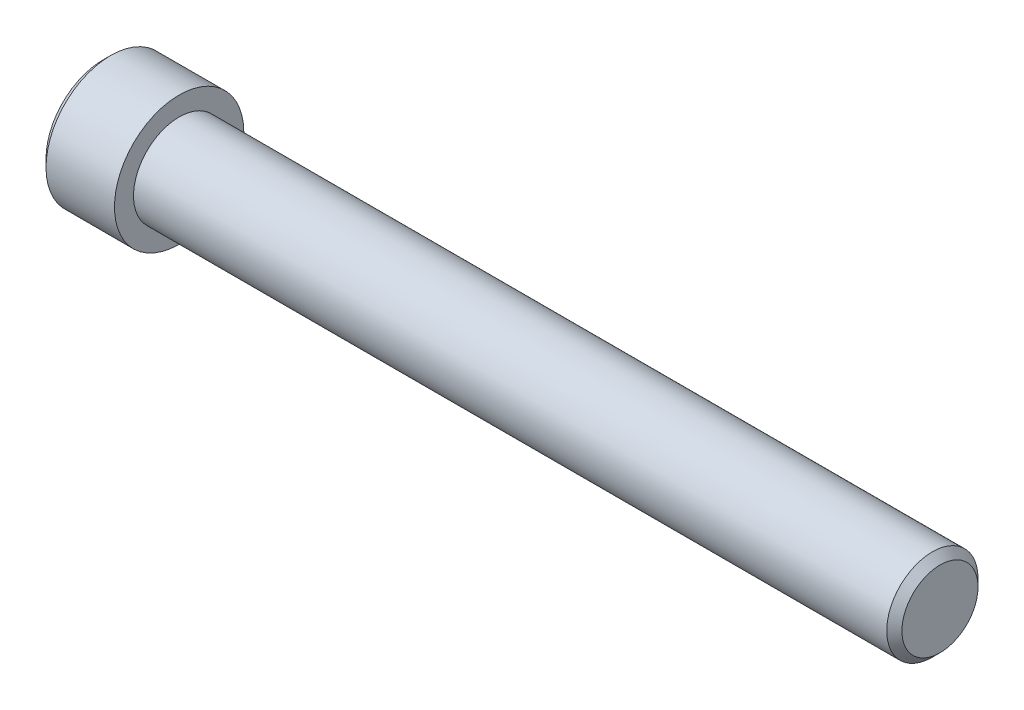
ISO-10303-21;
HEADER;
FILE_DESCRIPTION(('STEP AP214'),'2;1');
FILE_NAME('part.step','',(''),(''),'','','');
FILE_SCHEMA(('AUTOMOTIVE_DESIGN { 1 0 10303 214 1 1 1 1 }'));
ENDSEC;
DATA;
#1=APPLICATION_CONTEXT('core data for automotive mechanical design processes');
#2=APPLICATION_PROTOCOL_DEFINITION('international standard','automotive_design',2000,#1);
#3=PRODUCT_CONTEXT('',#1,'mechanical');
#4=PRODUCT('Part','Part','',(#3));
#5=PRODUCT_RELATED_PRODUCT_CATEGORY('part','',(#4));
#6=PRODUCT_DEFINITION_FORMATION('','',#4);
#7=PRODUCT_DEFINITION_CONTEXT('part definition',#1,'design');
#8=PRODUCT_DEFINITION('design','',#6,#7);
#9=PRODUCT_DEFINITION_SHAPE('','',#8);
#10=(LENGTH_UNIT() NAMED_UNIT(*) SI_UNIT(.MILLI.,.METRE.));
#11=(NAMED_UNIT(*) PLANE_ANGLE_UNIT() SI_UNIT($,.RADIAN.));
#12=(NAMED_UNIT(*) SI_UNIT($,.STERADIAN.) SOLID_ANGLE_UNIT());
#13=UNCERTAINTY_MEASURE_WITH_UNIT(LENGTH_MEASURE(1.E-05),#10,'distance_accuracy_value','');
#14=(GEOMETRIC_REPRESENTATION_CONTEXT(3) GLOBAL_UNCERTAINTY_ASSIGNED_CONTEXT((#13)) GLOBAL_UNIT_ASSIGNED_CONTEXT((#10,
#11,#12)) REPRESENTATION_CONTEXT('',''));
#15=CARTESIAN_POINT('',(0.,0.,0.));
#16=DIRECTION('',(0.,0.,1.));
#17=DIRECTION('',(1.,0.,0.));
#18=AXIS2_PLACEMENT_3D('',#15,#16,#17);
#19=CARTESIAN_POINT('',(-7.49999999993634,0.,0.));
#20=DIRECTION('',(-1.,0.,0.));
#21=DIRECTION('',(0.,0.,1.));
#22=AXIS2_PLACEMENT_3D('',#19,#20,#21);
#23=CONICAL_SURFACE('',#22,2.30940107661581,1.16215847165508);
#24=CARTESIAN_POINT('',(-6.4999999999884,0.,5.6843418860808E-11));
#25=VERTEX_POINT('',#24);
#26=VERTEX_LOOP('',#25);
#27=FACE_BOUND('',#26,.T.);
#28=CARTESIAN_POINT('',(-7.49999999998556,0.,0.));
#29=DIRECTION('',(-1.,0.,0.));
#30=DIRECTION('',(0.,0.,1.));
#31=AXIS2_PLACEMENT_3D('',#28,#29,#30);
#32=CIRCLE('',#31,2.3094010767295);
#33=CARTESIAN_POINT('',(-7.49999999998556,-1.15470053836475,-1.99999999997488));
#34=VERTEX_POINT('',#33);
#35=CARTESIAN_POINT('',(-7.49999999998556,-2.3094010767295,0.));
#36=VERTEX_POINT('',#35);
#37=EDGE_CURVE('E93',#34,#36,#32,.T.);
#38=ORIENTED_EDGE('',*,*,#37,.T.);
#39=CARTESIAN_POINT('',(-7.49999999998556,0.,0.));
#40=DIRECTION('',(-1.,0.,0.));
#41=DIRECTION('',(0.,0.,1.));
#42=AXIS2_PLACEMENT_3D('',#39,#40,#41);
#43=CIRCLE('',#42,2.3094010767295);
#44=CARTESIAN_POINT('',(-7.49999999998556,-1.15470053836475,1.99999999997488));
#45=VERTEX_POINT('',#44);
#46=EDGE_CURVE('E120',#36,#45,#43,.T.);
#47=ORIENTED_EDGE('',*,*,#46,.T.);
#48=CARTESIAN_POINT('',(-7.49999999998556,0.,0.));
#49=DIRECTION('',(-1.,0.,0.));
#50=DIRECTION('',(0.,0.,1.));
#51=AXIS2_PLACEMENT_3D('',#48,#49,#50);
#52=CIRCLE('',#51,2.3094010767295);
#53=CARTESIAN_POINT('',(-7.49999999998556,1.15470053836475,1.99999999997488));
#54=VERTEX_POINT('',#53);
#55=EDGE_CURVE('E483',#45,#54,#52,.T.);
#56=ORIENTED_EDGE('',*,*,#55,.T.);
#57=CARTESIAN_POINT('',(-7.49999999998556,0.,0.));
#58=DIRECTION('',(-1.,0.,0.));
#59=DIRECTION('',(0.,0.,1.));
#60=AXIS2_PLACEMENT_3D('',#57,#58,#59);
#61=CIRCLE('',#60,2.3094010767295);
#62=CARTESIAN_POINT('',(-7.49999999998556,2.3094010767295,0.));
#63=VERTEX_POINT('',#62);
#64=EDGE_CURVE('E212',#54,#63,#61,.T.);
#65=ORIENTED_EDGE('',*,*,#64,.T.);
#66=CARTESIAN_POINT('',(-7.49999999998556,0.,0.));
#67=DIRECTION('',(-1.,0.,0.));
#68=DIRECTION('',(0.,0.,1.));
#69=AXIS2_PLACEMENT_3D('',#66,#67,#68);
#70=CIRCLE('',#69,2.3094010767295);
#71=CARTESIAN_POINT('',(-7.49999999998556,1.15470053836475,-1.99999999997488));
#72=VERTEX_POINT('',#71);
#73=EDGE_CURVE('E96',#63,#72,#70,.T.);
#74=ORIENTED_EDGE('',*,*,#73,.T.);
#75=CARTESIAN_POINT('',(-7.49999999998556,0.,0.));
#76=DIRECTION('',(-1.,0.,0.));
#77=DIRECTION('',(0.,0.,1.));
#78=AXIS2_PLACEMENT_3D('',#75,#76,#77);
#79=CIRCLE('',#78,2.3094010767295);
#80=EDGE_CURVE('E91',#72,#34,#79,.T.);
#81=ORIENTED_EDGE('',*,*,#80,.T.);
#82=EDGE_LOOP('',(#38,#47,#56,#65,#74,#81));
#83=FACE_BOUND('',#82,.T.);
#84=ADVANCED_FACE('F39',(#27,#83),#23,.F.);
#85=CARTESIAN_POINT('',(-7.5,0.,0.));
#86=DIRECTION('',(-1.,0.,0.));
#87=DIRECTION('',(0.,0.,1.));
#88=AXIS2_PLACEMENT_3D('',#85,#86,#87);
#89=PLANE('',#88);
#90=ORIENTED_EDGE('',*,*,#37,.F.);
#91=DIRECTION('',(0.,-0.5,0.866025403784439));
#92=VECTOR('',#91,1.);
#93=CARTESIAN_POINT('',(-7.5,-1.73205080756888,-1.));
#94=LINE('',#93,#92);
#95=EDGE_CURVE('E105',#36,#34,#94,.F.);
#96=ORIENTED_EDGE('',*,*,#95,.F.);
#97=EDGE_LOOP('',(#90,#96));
#98=FACE_BOUND('',#97,.T.);
#99=ADVANCED_FACE('F104',(#98),#89,.F.);
#100=CARTESIAN_POINT('',(-7.5,0.,0.));
#101=DIRECTION('',(-1.,0.,0.));
#102=DIRECTION('',(0.,0.,1.));
#103=AXIS2_PLACEMENT_3D('',#100,#101,#102);
#104=PLANE('',#103);
#105=ORIENTED_EDGE('',*,*,#80,.F.);
#106=DIRECTION('',(0.,1.,0.));
#107=VECTOR('',#106,1.);
#108=CARTESIAN_POINT('',(-7.5,0.,-2.));
#109=LINE('',#108,#107);
#110=EDGE_CURVE('E122',#34,#72,#109,.T.);
#111=ORIENTED_EDGE('',*,*,#110,.F.);
#112=EDGE_LOOP('',(#105,#111));
#113=FACE_BOUND('',#112,.T.);
#114=ADVANCED_FACE('F123',(#113),#104,.F.);
#115=CARTESIAN_POINT('',(-7.5,0.,0.));
#116=DIRECTION('',(-1.,0.,0.));
#117=DIRECTION('',(0.,0.,1.));
#118=AXIS2_PLACEMENT_3D('',#115,#116,#117);
#119=PLANE('',#118);
#120=ORIENTED_EDGE('',*,*,#73,.F.);
#121=DIRECTION('',(0.,-0.5,-0.866025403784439));
#122=VECTOR('',#121,1.);
#123=CARTESIAN_POINT('',(-7.5,1.73205080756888,-1.));
#124=LINE('',#123,#122);
#125=EDGE_CURVE('E170',#72,#63,#124,.F.);
#126=ORIENTED_EDGE('',*,*,#125,.F.);
#127=EDGE_LOOP('',(#120,#126));
#128=FACE_BOUND('',#127,.T.);
#129=ADVANCED_FACE('F316',(#128),#119,.F.);
#130=CARTESIAN_POINT('',(-7.5,0.,0.));
#131=DIRECTION('',(-1.,0.,0.));
#132=DIRECTION('',(0.,0.,1.));
#133=AXIS2_PLACEMENT_3D('',#130,#131,#132);
#134=PLANE('',#133);
#135=ORIENTED_EDGE('',*,*,#64,.F.);
#136=DIRECTION('',(0.,0.5,-0.866025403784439));
#137=VECTOR('',#136,1.);
#138=CARTESIAN_POINT('',(-7.5,1.73205080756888,1.));
#139=LINE('',#138,#137);
#140=EDGE_CURVE('E191',#63,#54,#139,.F.);
#141=ORIENTED_EDGE('',*,*,#140,.F.);
#142=EDGE_LOOP('',(#135,#141));
#143=FACE_BOUND('',#142,.T.);
#144=ADVANCED_FACE('F211',(#143),#134,.F.);
#145=CARTESIAN_POINT('',(-7.5,0.,0.));
#146=DIRECTION('',(-1.,0.,0.));
#147=DIRECTION('',(0.,0.,1.));
#148=AXIS2_PLACEMENT_3D('',#145,#146,#147);
#149=PLANE('',#148);
#150=ORIENTED_EDGE('',*,*,#55,.F.);
#151=DIRECTION('',(0.,1.,0.));
#152=VECTOR('',#151,1.);
#153=CARTESIAN_POINT('',(-7.5,0.,2.));
#154=LINE('',#153,#152);
#155=EDGE_CURVE('E220',#54,#45,#154,.F.);
#156=ORIENTED_EDGE('',*,*,#155,.F.);
#157=EDGE_LOOP('',(#150,#156));
#158=FACE_BOUND('',#157,.T.);
#159=ADVANCED_FACE('F309',(#158),#149,.F.);
#160=CARTESIAN_POINT('',(-7.5,0.,0.));
#161=DIRECTION('',(-1.,0.,0.));
#162=DIRECTION('',(0.,0.,1.));
#163=AXIS2_PLACEMENT_3D('',#160,#161,#162);
#164=PLANE('',#163);
#165=ORIENTED_EDGE('',*,*,#46,.F.);
#166=DIRECTION('',(0.,0.5,0.866025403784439));
#167=VECTOR('',#166,1.);
#168=CARTESIAN_POINT('',(-7.5,-1.73205080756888,1.));
#169=LINE('',#168,#167);
#170=EDGE_CURVE('E242',#45,#36,#169,.F.);
#171=ORIENTED_EDGE('',*,*,#170,.F.);
#172=EDGE_LOOP('',(#165,#171));
#173=FACE_BOUND('',#172,.T.);
#174=ADVANCED_FACE('F306',(#173),#164,.F.);
#175=CARTESIAN_POINT('',(-8.75,-1.73205080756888,-1.));
#176=DIRECTION('',(0.,0.866025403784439,0.5));
#177=DIRECTION('',(0.,-0.5,0.866025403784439));
#178=AXIS2_PLACEMENT_3D('',#175,#176,#177);
#179=PLANE('',#178);
#180=DIRECTION('',(1.,0.,0.));
#181=VECTOR('',#180,1.);
#182=CARTESIAN_POINT('',(-8.75,-1.15470053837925,-2.));
#183=LINE('',#182,#181);
#184=CARTESIAN_POINT('',(-10.,-1.15470053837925,-2.));
#185=VERTEX_POINT('',#184);
#186=EDGE_CURVE('E114',#185,#34,#183,.T.);
#187=ORIENTED_EDGE('',*,*,#186,.F.);
#188=DIRECTION('',(0.,0.499999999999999,-0.866025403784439));
#189=VECTOR('',#188,1.);
#190=CARTESIAN_POINT('',(-10.,-2.3094010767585,0.));
#191=LINE('',#190,#189);
#192=CARTESIAN_POINT('',(-10.,-2.3094010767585,0.));
#193=VERTEX_POINT('',#192);
#194=EDGE_CURVE('E142',#193,#185,#191,.T.);
#195=ORIENTED_EDGE('',*,*,#194,.F.);
#196=DIRECTION('',(1.,0.,0.));
#197=VECTOR('',#196,1.);
#198=CARTESIAN_POINT('',(-8.75,-2.3094010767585,0.));
#199=LINE('',#198,#197);
#200=EDGE_CURVE('E117',#36,#193,#199,.F.);
#201=ORIENTED_EDGE('',*,*,#200,.F.);
#202=ORIENTED_EDGE('',*,*,#95,.T.);
#203=EDGE_LOOP('',(#187,#195,#201,#202));
#204=FACE_BOUND('',#203,.T.);
#205=ADVANCED_FACE('F111',(#204),#179,.T.);
#206=CARTESIAN_POINT('',(-8.75,0.,-2.));
#207=DIRECTION('',(0.,0.,1.));
#208=DIRECTION('',(1.,0.,0.));
#209=AXIS2_PLACEMENT_3D('',#206,#207,#208);
#210=PLANE('',#209);
#211=DIRECTION('',(1.,0.,0.));
#212=VECTOR('',#211,1.);
#213=CARTESIAN_POINT('',(-8.75,1.15470053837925,-2.));
#214=LINE('',#213,#212);
#215=CARTESIAN_POINT('',(-10.,1.15470053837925,-2.));
#216=VERTEX_POINT('',#215);
#217=EDGE_CURVE('E127',#216,#72,#214,.T.);
#218=ORIENTED_EDGE('',*,*,#217,.F.);
#219=DIRECTION('',(0.,1.,0.));
#220=VECTOR('',#219,1.);
#221=CARTESIAN_POINT('',(-10.,0.,-2.));
#222=LINE('',#221,#220);
#223=EDGE_CURVE('E131',#185,#216,#222,.T.);
#224=ORIENTED_EDGE('',*,*,#223,.F.);
#225=ORIENTED_EDGE('',*,*,#186,.T.);
#226=ORIENTED_EDGE('',*,*,#110,.T.);
#227=EDGE_LOOP('',(#218,#224,#225,#226));
#228=FACE_BOUND('',#227,.T.);
#229=ADVANCED_FACE('F129',(#228),#210,.T.);
#230=CARTESIAN_POINT('',(-8.75,1.73205080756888,-1.));
#231=DIRECTION('',(0.,-0.866025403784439,0.5));
#232=DIRECTION('',(0.,-0.5,-0.866025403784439));
#233=AXIS2_PLACEMENT_3D('',#230,#231,#232);
#234=PLANE('',#233);
#235=DIRECTION('',(1.,0.,0.));
#236=VECTOR('',#235,1.);
#237=CARTESIAN_POINT('',(-8.75,2.3094010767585,0.));
#238=LINE('',#237,#236);
#239=CARTESIAN_POINT('',(-10.,2.3094010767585,0.));
#240=VERTEX_POINT('',#239);
#241=EDGE_CURVE('E195',#240,#63,#238,.T.);
#242=ORIENTED_EDGE('',*,*,#241,.F.);
#243=DIRECTION('',(0.,0.5,0.866025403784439));
#244=VECTOR('',#243,1.);
#245=CARTESIAN_POINT('',(-10.,1.15470053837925,-2.));
#246=LINE('',#245,#244);
#247=EDGE_CURVE('E164',#216,#240,#246,.T.);
#248=ORIENTED_EDGE('',*,*,#247,.F.);
#249=ORIENTED_EDGE('',*,*,#217,.T.);
#250=ORIENTED_EDGE('',*,*,#125,.T.);
#251=EDGE_LOOP('',(#242,#248,#249,#250));
#252=FACE_BOUND('',#251,.T.);
#253=ADVANCED_FACE('F206',(#252),#234,.T.);
#254=CARTESIAN_POINT('',(-8.75,1.73205080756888,1.));
#255=DIRECTION('',(0.,-0.866025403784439,-0.5));
#256=DIRECTION('',(0.,0.5,-0.866025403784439));
#257=AXIS2_PLACEMENT_3D('',#254,#255,#256);
#258=PLANE('',#257);
#259=DIRECTION('',(-1.,0.,0.));
#260=VECTOR('',#259,1.);
#261=CARTESIAN_POINT('',(-8.75,1.15470053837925,2.));
#262=LINE('',#261,#260);
#263=CARTESIAN_POINT('',(-10.,1.15470053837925,2.));
#264=VERTEX_POINT('',#263);
#265=EDGE_CURVE('E216',#264,#54,#262,.F.);
#266=ORIENTED_EDGE('',*,*,#265,.F.);
#267=DIRECTION('',(0.,-0.499999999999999,0.866025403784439));
#268=VECTOR('',#267,1.);
#269=CARTESIAN_POINT('',(-10.,2.3094010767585,0.));
#270=LINE('',#269,#268);
#271=EDGE_CURVE('E177',#240,#264,#270,.T.);
#272=ORIENTED_EDGE('',*,*,#271,.F.);
#273=ORIENTED_EDGE('',*,*,#241,.T.);
#274=ORIENTED_EDGE('',*,*,#140,.T.);
#275=EDGE_LOOP('',(#266,#272,#273,#274));
#276=FACE_BOUND('',#275,.T.);
#277=ADVANCED_FACE('F217',(#276),#258,.T.);
#278=CARTESIAN_POINT('',(-8.75,0.,2.));
#279=DIRECTION('',(0.,0.,-1.));
#280=DIRECTION('',(-1.,0.,0.));
#281=AXIS2_PLACEMENT_3D('',#278,#279,#280);
#282=PLANE('',#281);
#283=DIRECTION('',(1.,0.,0.));
#284=VECTOR('',#283,1.);
#285=CARTESIAN_POINT('',(-8.75,-1.15470053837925,2.));
#286=LINE('',#285,#284);
#287=CARTESIAN_POINT('',(-10.,-1.15470053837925,2.));
#288=VERTEX_POINT('',#287);
#289=EDGE_CURVE('E56',#288,#45,#286,.T.);
#290=ORIENTED_EDGE('',*,*,#289,.F.);
#291=DIRECTION('',(0.,1.,0.));
#292=VECTOR('',#291,1.);
#293=CARTESIAN_POINT('',(-10.,0.,2.));
#294=LINE('',#293,#292);
#295=EDGE_CURVE('E182',#264,#288,#294,.F.);
#296=ORIENTED_EDGE('',*,*,#295,.F.);
#297=ORIENTED_EDGE('',*,*,#265,.T.);
#298=ORIENTED_EDGE('',*,*,#155,.T.);
#299=EDGE_LOOP('',(#290,#296,#297,#298));
#300=FACE_BOUND('',#299,.T.);
#301=ADVANCED_FACE('F222',(#300),#282,.T.);
#302=CARTESIAN_POINT('',(-8.75,-1.73205080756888,1.));
#303=DIRECTION('',(0.,0.866025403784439,-0.5));
#304=DIRECTION('',(0.,0.5,0.866025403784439));
#305=AXIS2_PLACEMENT_3D('',#302,#303,#304);
#306=PLANE('',#305);
#307=ORIENTED_EDGE('',*,*,#200,.T.);
#308=DIRECTION('',(0.,-0.5,-0.866025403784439));
#309=VECTOR('',#308,1.);
#310=CARTESIAN_POINT('',(-10.,-1.15470053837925,2.));
#311=LINE('',#310,#309);
#312=EDGE_CURVE('E188',#288,#193,#311,.T.);
#313=ORIENTED_EDGE('',*,*,#312,.F.);
#314=ORIENTED_EDGE('',*,*,#289,.T.);
#315=ORIENTED_EDGE('',*,*,#170,.T.);
#316=EDGE_LOOP('',(#307,#313,#314,#315));
#317=FACE_BOUND('',#316,.T.);
#318=ADVANCED_FACE('F293',(#317),#306,.T.);
#319=CARTESIAN_POINT('',(-10.,0.,0.));
#320=DIRECTION('',(-1.,0.,0.));
#321=DIRECTION('',(0.,0.,1.));
#322=AXIS2_PLACEMENT_3D('',#319,#320,#321);
#323=PLANE('',#322);
#324=CARTESIAN_POINT('',(-10.,0.,0.));
#325=DIRECTION('',(-1.,0.,0.));
#326=DIRECTION('',(0.,0.,1.));
#327=AXIS2_PLACEMENT_3D('',#324,#325,#326);
#328=CIRCLE('',#327,3.74999999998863);
#329=CARTESIAN_POINT('',(-10.,0.,3.74999999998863));
#330=VERTEX_POINT('',#329);
#331=EDGE_CURVE('E48',#330,#330,#328,.T.);
#332=ORIENTED_EDGE('',*,*,#331,.T.);
#333=EDGE_LOOP('',(#332));
#334=FACE_BOUND('',#333,.T.);
#335=ORIENTED_EDGE('',*,*,#295,.T.);
#336=ORIENTED_EDGE('',*,*,#312,.T.);
#337=ORIENTED_EDGE('',*,*,#194,.T.);
#338=ORIENTED_EDGE('',*,*,#223,.T.);
#339=ORIENTED_EDGE('',*,*,#247,.T.);
#340=ORIENTED_EDGE('',*,*,#271,.T.);
#341=EDGE_LOOP('',(#335,#336,#337,#338,#339,#340));
#342=FACE_BOUND('',#341,.T.);
#343=ADVANCED_FACE('F224',(#334,#342),#323,.T.);
#344=CARTESIAN_POINT('',(-7.5,0.,0.));
#345=DIRECTION('',(1.,0.,0.));
#346=DIRECTION('',(0.,0.,-1.));
#347=AXIS2_PLACEMENT_3D('',#344,#345,#346);
#348=CYLINDRICAL_SURFACE('',#347,4.25);
#349=CARTESIAN_POINT('',(-9.49999999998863,0.,0.));
#350=DIRECTION('',(-1.,0.,0.));
#351=DIRECTION('',(0.,0.,1.));
#352=AXIS2_PLACEMENT_3D('',#349,#350,#351);
#353=CIRCLE('',#352,4.25);
#354=CARTESIAN_POINT('',(-9.49999999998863,0.,4.25));
#355=VERTEX_POINT('',#354);
#356=EDGE_CURVE('E12',#355,#355,#353,.F.);
#357=ORIENTED_EDGE('',*,*,#356,.T.);
#358=EDGE_LOOP('',(#357));
#359=FACE_BOUND('',#358,.T.);
#360=CARTESIAN_POINT('',(-5.,0.,0.));
#361=DIRECTION('',(1.,0.,0.));
#362=DIRECTION('',(0.,0.,-1.));
#363=AXIS2_PLACEMENT_3D('',#360,#361,#362);
#364=CIRCLE('',#363,4.25);
#365=CARTESIAN_POINT('',(-5.,0.,-4.25));
#366=VERTEX_POINT('',#365);
#367=EDGE_CURVE('E147',#366,#366,#364,.T.);
#368=ORIENTED_EDGE('',*,*,#367,.F.);
#369=EDGE_LOOP('',(#368));
#370=FACE_BOUND('',#369,.T.);
#371=ADVANCED_FACE('F277',(#359,#370),#348,.T.);
#372=CARTESIAN_POINT('',(-5.,0.,0.));
#373=DIRECTION('',(1.,0.,0.));
#374=DIRECTION('',(0.,0.,-1.));
#375=AXIS2_PLACEMENT_3D('',#372,#373,#374);
#376=PLANE('',#375);
#377=CARTESIAN_POINT('',(-5.,0.,0.));
#378=DIRECTION('',(1.,0.,0.));
#379=DIRECTION('',(0.,0.,-1.));
#380=AXIS2_PLACEMENT_3D('',#377,#378,#379);
#381=CIRCLE('',#380,3.);
#382=CARTESIAN_POINT('',(-5.,0.,-3.));
#383=VERTEX_POINT('',#382);
#384=EDGE_CURVE('E231',#383,#383,#381,.T.);
#385=ORIENTED_EDGE('',*,*,#384,.F.);
#386=EDGE_LOOP('',(#385));
#387=FACE_BOUND('',#386,.T.);
#388=ORIENTED_EDGE('',*,*,#367,.T.);
#389=EDGE_LOOP('',(#388));
#390=FACE_BOUND('',#389,.T.);
#391=ADVANCED_FACE('F274',(#387,#390),#376,.T.);
#392=CARTESIAN_POINT('',(45.,0.,0.));
#393=DIRECTION('',(-1.,0.,0.));
#394=DIRECTION('',(0.,0.,1.));
#395=AXIS2_PLACEMENT_3D('',#392,#393,#394);
#396=CYLINDRICAL_SURFACE('',#395,3.);
#397=CARTESIAN_POINT('',(44.4999999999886,0.,0.));
#398=DIRECTION('',(1.,0.,0.));
#399=DIRECTION('',(0.,0.,-1.));
#400=AXIS2_PLACEMENT_3D('',#397,#398,#399);
#401=CIRCLE('',#400,3.);
#402=CARTESIAN_POINT('',(44.4999999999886,0.,-3.));
#403=VERTEX_POINT('',#402);
#404=EDGE_CURVE('E254',#403,#403,#401,.F.);
#405=ORIENTED_EDGE('',*,*,#404,.T.);
#406=EDGE_LOOP('',(#405));
#407=FACE_BOUND('',#406,.T.);
#408=ORIENTED_EDGE('',*,*,#384,.T.);
#409=EDGE_LOOP('',(#408));
#410=FACE_BOUND('',#409,.T.);
#411=ADVANCED_FACE('F276',(#407,#410),#396,.T.);
#412=CARTESIAN_POINT('',(45.,0.,0.));
#413=DIRECTION('',(1.,0.,0.));
#414=DIRECTION('',(0.,0.,-1.));
#415=AXIS2_PLACEMENT_3D('',#412,#413,#414);
#416=PLANE('',#415);
#417=CARTESIAN_POINT('',(45.,0.,0.));
#418=DIRECTION('',(1.,0.,0.));
#419=DIRECTION('',(0.,0.,-1.));
#420=AXIS2_PLACEMENT_3D('',#417,#418,#419);
#421=CIRCLE('',#420,2.49999999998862);
#422=CARTESIAN_POINT('',(45.,0.,-2.49999999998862));
#423=VERTEX_POINT('',#422);
#424=EDGE_CURVE('E250',#423,#423,#421,.T.);
#425=ORIENTED_EDGE('',*,*,#424,.T.);
#426=EDGE_LOOP('',(#425));
#427=FACE_BOUND('',#426,.T.);
#428=ADVANCED_FACE('F271',(#427),#416,.T.);
#429=CARTESIAN_POINT('',(45.,0.,0.));
#430=DIRECTION('',(-1.,0.,0.));
#431=DIRECTION('',(0.,0.,1.));
#432=AXIS2_PLACEMENT_3D('',#429,#430,#431);
#433=CONICAL_SURFACE('',#432,2.49999999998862,0.785398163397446);
#434=ORIENTED_EDGE('',*,*,#404,.F.);
#435=EDGE_LOOP('',(#434));
#436=FACE_BOUND('',#435,.T.);
#437=ORIENTED_EDGE('',*,*,#424,.F.);
#438=EDGE_LOOP('',(#437));
#439=FACE_BOUND('',#438,.T.);
#440=ADVANCED_FACE('F266',(#436,#439),#433,.T.);
#441=CARTESIAN_POINT('',(-10.,0.,0.));
#442=DIRECTION('',(1.,0.,0.));
#443=DIRECTION('',(0.,0.,-1.));
#444=AXIS2_PLACEMENT_3D('',#441,#442,#443);
#445=CONICAL_SURFACE('',#444,3.74999999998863,0.785398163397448);
#446=ORIENTED_EDGE('',*,*,#356,.F.);
#447=EDGE_LOOP('',(#446));
#448=FACE_BOUND('',#447,.T.);
#449=ORIENTED_EDGE('',*,*,#331,.F.);
#450=EDGE_LOOP('',(#449));
#451=FACE_BOUND('',#450,.T.);
#452=ADVANCED_FACE('F41',(#448,#451),#445,.T.);
#453=CLOSED_SHELL('',(#84,#99,#114,#129,#144,#159,#174,#205,#229,#253,#277,#301,#318,#343,#371,
#391,#411,#428,#440,#452));
#454=MANIFOLD_SOLID_BREP('B2',#453);
#455=ADVANCED_BREP_SHAPE_REPRESENTATION('',(#18,#454),#14);
#456=SHAPE_DEFINITION_REPRESENTATION(#9,#455);
ENDSEC;
END-ISO-10303-21;
